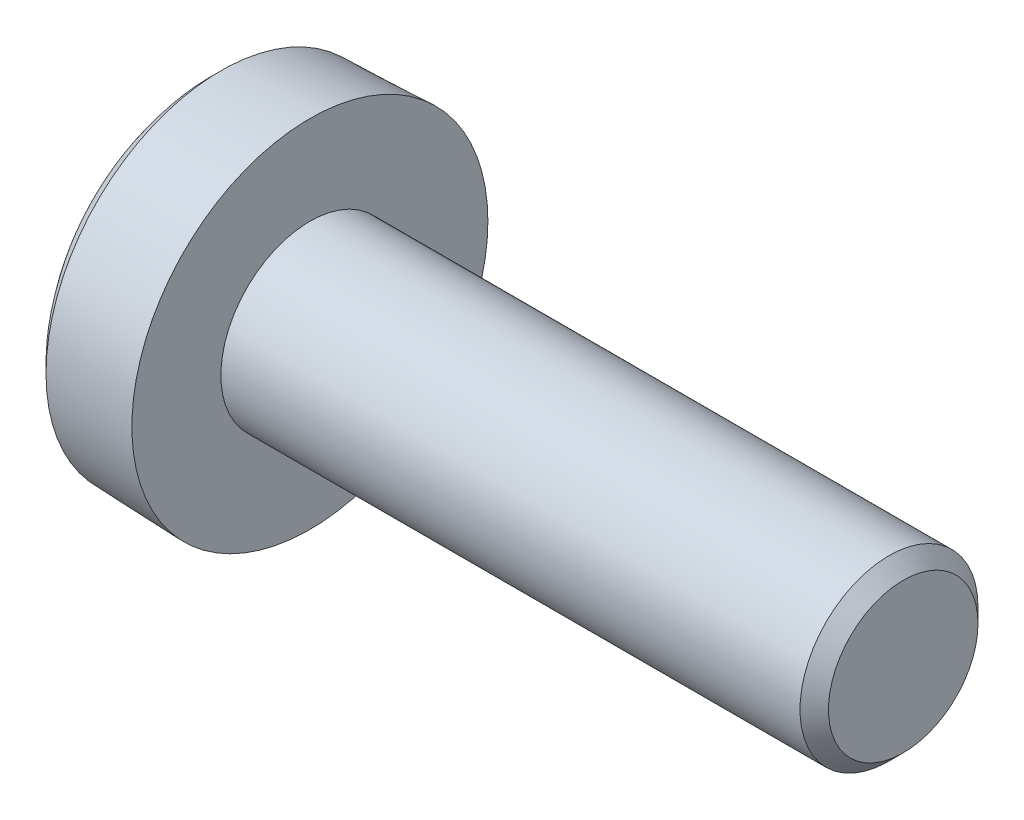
from build123d import *

# Parameters (mm, degrees)
ENL_V_START             = -1
ENL_V_MAT_EXTRU_1_DEPTH = 21.725560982


with BuildPart() as part:
    # Esquisse1 → R_volution1 (revolve)
    with BuildSketch(Plane(origin=(0, 0, 0), x_dir=(1, 0, 0), z_dir=(0, 1, 0))):
        with BuildLine():
            Line((20, 0), (20, 2.52))
            Line((20, 2.52), (19.52, 3))
            Line((19.52, 3), (0, 3))
            Line((0, 3), (0, 6))
            Line((0, 6), (-3, 5.895237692))
            ThreePointArc((-3, 5.895237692), (-4.108114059, 4.366769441), (-4.5, 2.52))
            Line((-4.5, 2.52), (-4.5, 0))
            Line((-4.5, 0), (20, 0))
        make_face()
    revolve(axis=Axis((27.496338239, 0, 0), (-1, 0, 0)))

    # Esquisse3 → Enl_v. mat.-Extru.1 (cut, through all)
    with BuildSketch(Plane(origin=(0, 0, 0), x_dir=(0, 0, -1), z_dir=(1, 0, 0)).offset(ENL_V_START)):
        Polygon((0, 3), (-2.598076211, 1.5), (-2.598076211, -1.5), (0, -3), (2.598076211, -1.5), (2.598076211, 1.5), align=None)
    extrude(amount=-ENL_V_MAT_EXTRU_1_DEPTH, mode=Mode.SUBTRACT)

    # Esquisse5 → Enl_vement de mati_re-R_volution1 (revolve, cut)
    with BuildSketch(Plane.XY, mode=Mode.PRIVATE) as enl_vement_de_mati_re_r_volution1_sk:
        Polygon((-4.474595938, 3), (-3.474595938, 2), (-3.474595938, 0), (-5.474595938, 0), (-5.474595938, 4), align=None)
    revolve(enl_vement_de_mati_re_r_volution1_sk.sketch.rotate(Axis((-3.474595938, 0, 0), (-1, 0, 0)), 90), axis=Axis((-3.474595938, 0, 0), (-1, 0, 0)), mode=Mode.SUBTRACT)


solid = part.part
